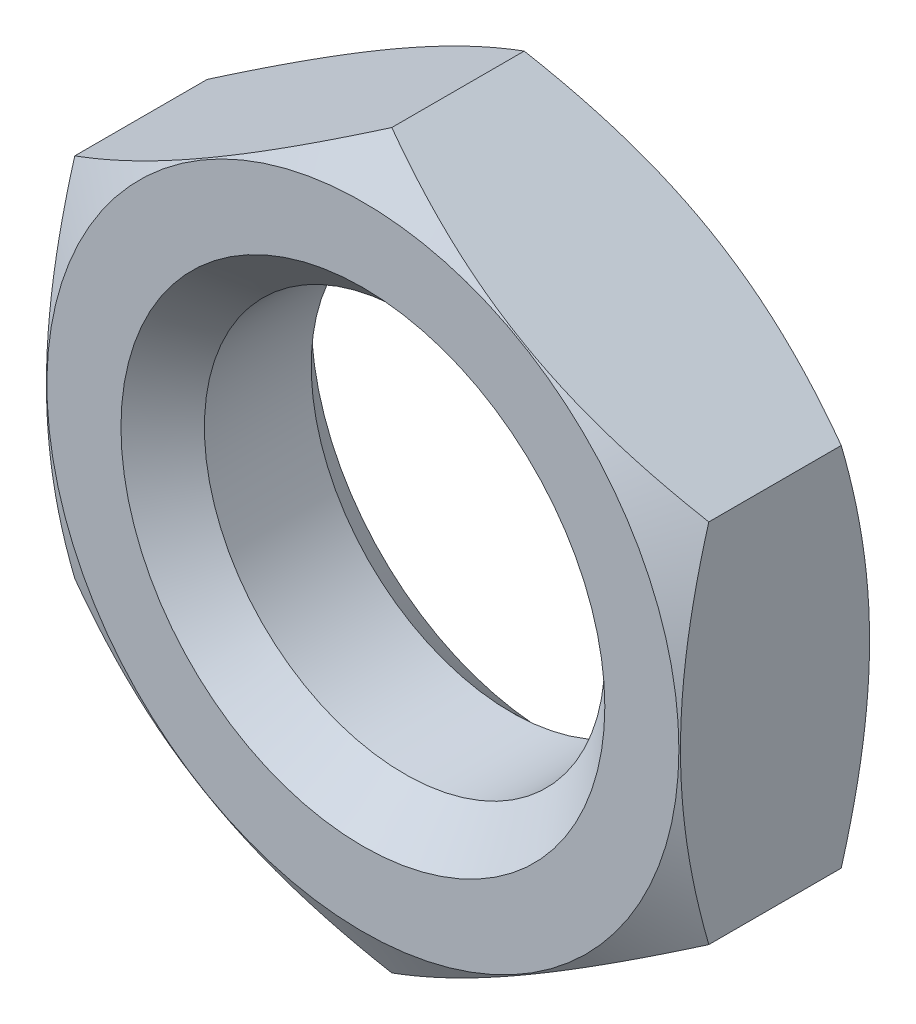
from build123d import *

# Parameters (mm, degrees)
BOSS_EXTRUDE1_DEPTH = 2.85
SKETCH6_R           = 6
CUT_EXTRUDE1_DEPTH  = 5.7
CHAMFER1_SIZE       = 1.25


with BuildPart() as part:
    # Sketch3 → Boss-Extrude1 (new, symmetric)
    with BuildSketch(Plane.XY):
        Polygon((0, 10.969655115), (-9.5, 5.484827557), (-9.5, -5.484827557), (0, -10.969655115), (9.5, -5.484827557), (9.5, 5.484827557), align=None)
    extrude(amount=BOSS_EXTRUDE1_DEPTH, both=True)

    # Sketch5 → Cut-Revolve1 (revolve, cut)
    with BuildSketch(Plane(origin=(0, 0, 0), x_dir=(0, 0, -1), z_dir=(1, 0, 0)), mode=Mode.PRIVATE) as cut_revolve1_sk:
        Polygon((-2.85, 10.969655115), (-2.85, 9.469655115), (-1.983974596, 10.969655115), align=None)
    cut_revolve1 = revolve(cut_revolve1_sk.sketch.rotate(Axis((0, 0, 5.457798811), (0, 0, -1)), 300.000000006), axis=Axis((0, 0, 5.457798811), (0, 0, -1)), mode=Mode.SUBTRACT)

    # Mirror1: Cut-Revolve1 across plane
    add(cut_revolve1.mirror(Plane.XY), mode=Mode.SUBTRACT)

    # Sketch6 → Cut-Extrude1 (cut)
    with BuildSketch(Plane.XY.offset(2.85)):
        Circle(SKETCH6_R)
    extrude(amount=-CUT_EXTRUDE1_DEPTH, mode=Mode.SUBTRACT)

    # Chamfer1
    chamfer1_edges = [part.edges().sort_by_distance(p)[0] for p in [
        (-6, 0, -2.85),
        (-6, 0, 2.85),
    ]]
    chamfer(chamfer1_edges, length=CHAMFER1_SIZE)


solid = part.part
